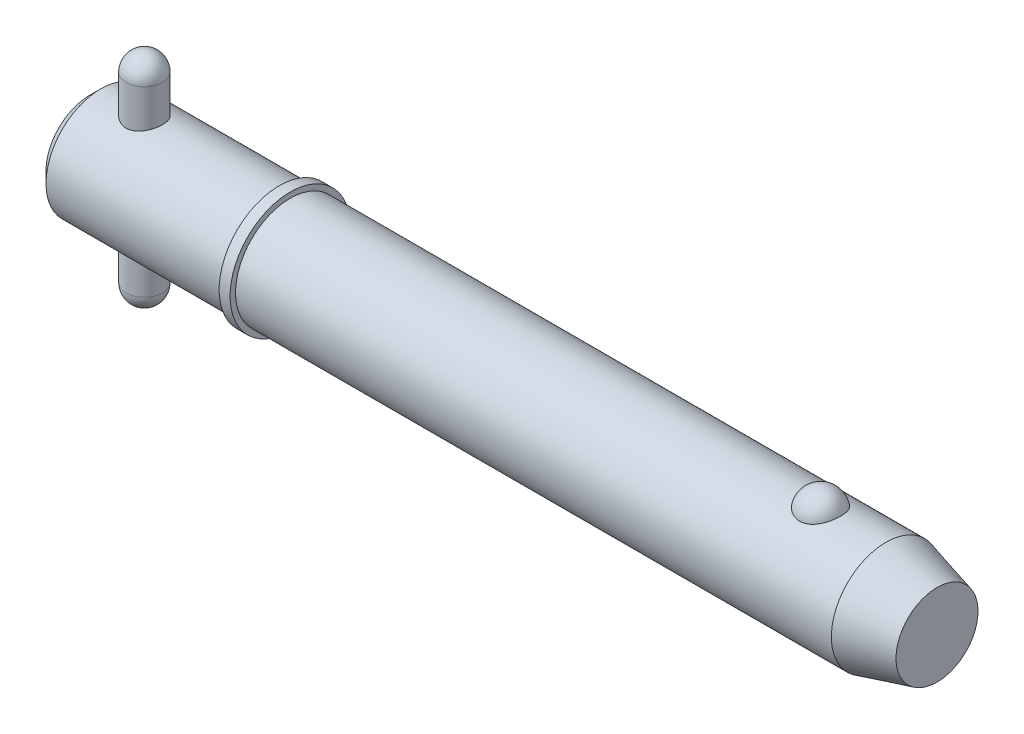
ISO-10303-21;
HEADER;
FILE_DESCRIPTION(('STEP AP214'),'2;1');
FILE_NAME('part.step','',(''),(''),'','','');
FILE_SCHEMA(('AUTOMOTIVE_DESIGN { 1 0 10303 214 1 1 1 1 }'));
ENDSEC;
DATA;
#1=APPLICATION_CONTEXT('core data for automotive mechanical design processes');
#2=APPLICATION_PROTOCOL_DEFINITION('international standard','automotive_design',2000,#1);
#3=PRODUCT_CONTEXT('',#1,'mechanical');
#4=PRODUCT('Part','Part','',(#3));
#5=PRODUCT_RELATED_PRODUCT_CATEGORY('part','',(#4));
#6=PRODUCT_DEFINITION_FORMATION('','',#4);
#7=PRODUCT_DEFINITION_CONTEXT('part definition',#1,'design');
#8=PRODUCT_DEFINITION('design','',#6,#7);
#9=PRODUCT_DEFINITION_SHAPE('','',#8);
#10=(LENGTH_UNIT() NAMED_UNIT(*) SI_UNIT(.MILLI.,.METRE.));
#11=(NAMED_UNIT(*) PLANE_ANGLE_UNIT() SI_UNIT($,.RADIAN.));
#12=(NAMED_UNIT(*) SI_UNIT($,.STERADIAN.) SOLID_ANGLE_UNIT());
#13=UNCERTAINTY_MEASURE_WITH_UNIT(LENGTH_MEASURE(1.E-05),#10,'distance_accuracy_value','');
#14=(GEOMETRIC_REPRESENTATION_CONTEXT(3) GLOBAL_UNCERTAINTY_ASSIGNED_CONTEXT((#13)) GLOBAL_UNIT_ASSIGNED_CONTEXT((#10,
#11,#12)) REPRESENTATION_CONTEXT('',''));
#15=CARTESIAN_POINT('',(0.,0.,0.));
#16=DIRECTION('',(0.,0.,1.));
#17=DIRECTION('',(1.,0.,0.));
#18=AXIS2_PLACEMENT_3D('',#15,#16,#17);
#19=CARTESIAN_POINT('',(9.525,19.05,0.));
#20=DIRECTION('',(0.,-1.,0.));
#21=DIRECTION('',(0.,0.,-1.));
#22=AXIS2_PLACEMENT_3D('',#19,#20,#21);
#23=CYLINDRICAL_SURFACE('',#22,3.175);
#24=CARTESIAN_POINT('',(9.525,-15.875,0.));
#25=DIRECTION('',(0.,-1.,0.));
#26=DIRECTION('',(0.,0.,-1.));
#27=AXIS2_PLACEMENT_3D('',#24,#25,#26);
#28=CIRCLE('',#27,3.175);
#29=CARTESIAN_POINT('',(9.525,-15.875,-3.175));
#30=VERTEX_POINT('',#29);
#31=EDGE_CURVE('P0_E10',#30,#30,#28,.F.);
#32=CARTESIAN_POINT('',(9.525,15.875,0.));
#33=DIRECTION('',(0.,-1.,0.));
#34=DIRECTION('',(0.,0.,-1.));
#35=AXIS2_PLACEMENT_3D('',#32,#33,#34);
#36=CIRCLE('',#35,3.175);
#37=CARTESIAN_POINT('',(9.525,15.875,-3.175));
#38=VERTEX_POINT('',#37);
#39=EDGE_CURVE('P0_E21',#38,#38,#36,.T.);
#40=CARTESIAN_POINT('',(9.525,-15.875,-3.175));
#41=CARTESIAN_POINT('',(9.525,-15.5442708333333,-3.175));
#42=CARTESIAN_POINT('',(9.525,-15.2135416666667,-3.175));
#43=CARTESIAN_POINT('',(9.525,-14.5520833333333,-3.175));
#44=CARTESIAN_POINT('',(9.525,-14.2213541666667,-3.175));
#45=CARTESIAN_POINT('',(9.525,-13.5598958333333,-3.175));
#46=CARTESIAN_POINT('',(9.525,-13.2291666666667,-3.175));
#47=CARTESIAN_POINT('',(9.525,-12.5677083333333,-3.175));
#48=CARTESIAN_POINT('',(9.525,-12.2369791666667,-3.175));
#49=CARTESIAN_POINT('',(9.525,-11.5755208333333,-3.175));
#50=CARTESIAN_POINT('',(9.525,-11.2447916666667,-3.175));
#51=CARTESIAN_POINT('',(9.525,-10.5833333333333,-3.175));
#52=CARTESIAN_POINT('',(9.525,-10.2526041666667,-3.175));
#53=CARTESIAN_POINT('',(9.525,-9.59114583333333,-3.175));
#54=CARTESIAN_POINT('',(9.525,-9.26041666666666,-3.175));
#55=CARTESIAN_POINT('',(9.525,-8.59895833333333,-3.175));
#56=CARTESIAN_POINT('',(9.525,-8.26822916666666,-3.175));
#57=CARTESIAN_POINT('',(9.525,-7.60677083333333,-3.175));
#58=CARTESIAN_POINT('',(9.525,-7.27604166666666,-3.175));
#59=CARTESIAN_POINT('',(9.525,-6.61458333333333,-3.175));
#60=CARTESIAN_POINT('',(9.525,-6.28385416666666,-3.175));
#61=CARTESIAN_POINT('',(9.525,-5.62239583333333,-3.175));
#62=CARTESIAN_POINT('',(9.525,-5.29166666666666,-3.175));
#63=CARTESIAN_POINT('',(9.525,-4.63020833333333,-3.175));
#64=CARTESIAN_POINT('',(9.525,-4.29947916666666,-3.175));
#65=CARTESIAN_POINT('',(9.525,-3.63802083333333,-3.175));
#66=CARTESIAN_POINT('',(9.525,-3.30729166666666,-3.175));
#67=CARTESIAN_POINT('',(9.525,-2.64583333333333,-3.175));
#68=CARTESIAN_POINT('',(9.525,-2.31510416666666,-3.175));
#69=CARTESIAN_POINT('',(9.525,-1.65364583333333,-3.175));
#70=CARTESIAN_POINT('',(9.525,-1.32291666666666,-3.175));
#71=CARTESIAN_POINT('',(9.525,-0.661458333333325,-3.175));
#72=CARTESIAN_POINT('',(9.525,-0.330729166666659,-3.175));
#73=CARTESIAN_POINT('',(9.525,0.330729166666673,-3.175));
#74=CARTESIAN_POINT('',(9.525,0.661458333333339,-3.175));
#75=CARTESIAN_POINT('',(9.525,1.32291666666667,-3.175));
#76=CARTESIAN_POINT('',(9.525,1.65364583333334,-3.175));
#77=CARTESIAN_POINT('',(9.525,2.31510416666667,-3.175));
#78=CARTESIAN_POINT('',(9.525,2.64583333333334,-3.175));
#79=CARTESIAN_POINT('',(9.525,3.30729166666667,-3.175));
#80=CARTESIAN_POINT('',(9.525,3.63802083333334,-3.175));
#81=CARTESIAN_POINT('',(9.525,4.29947916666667,-3.175));
#82=CARTESIAN_POINT('',(9.525,4.63020833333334,-3.175));
#83=CARTESIAN_POINT('',(9.525,5.29166666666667,-3.175));
#84=CARTESIAN_POINT('',(9.525,5.62239583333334,-3.175));
#85=CARTESIAN_POINT('',(9.525,6.28385416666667,-3.175));
#86=CARTESIAN_POINT('',(9.525,6.61458333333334,-3.175));
#87=CARTESIAN_POINT('',(9.525,7.27604166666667,-3.175));
#88=CARTESIAN_POINT('',(9.525,7.60677083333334,-3.175));
#89=CARTESIAN_POINT('',(9.525,8.26822916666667,-3.175));
#90=CARTESIAN_POINT('',(9.525,8.59895833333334,-3.175));
#91=CARTESIAN_POINT('',(9.525,9.26041666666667,-3.175));
#92=CARTESIAN_POINT('',(9.525,9.59114583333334,-3.175));
#93=CARTESIAN_POINT('',(9.525,10.2526041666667,-3.175));
#94=CARTESIAN_POINT('',(9.525,10.5833333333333,-3.175));
#95=CARTESIAN_POINT('',(9.525,11.2447916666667,-3.175));
#96=CARTESIAN_POINT('',(9.525,11.5755208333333,-3.175));
#97=CARTESIAN_POINT('',(9.525,12.2369791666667,-3.175));
#98=CARTESIAN_POINT('',(9.525,12.5677083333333,-3.175));
#99=CARTESIAN_POINT('',(9.525,13.2291666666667,-3.175));
#100=CARTESIAN_POINT('',(9.525,13.5598958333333,-3.175));
#101=CARTESIAN_POINT('',(9.525,14.2213541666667,-3.175));
#102=CARTESIAN_POINT('',(9.525,14.5520833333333,-3.175));
#103=CARTESIAN_POINT('',(9.525,15.2135416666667,-3.175));
#104=CARTESIAN_POINT('',(9.525,15.5442708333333,-3.175));
#105=CARTESIAN_POINT('',(9.525,15.875,-3.175));
#106=B_SPLINE_CURVE_WITH_KNOTS('',3,(#40,#41,#42,#43,#44,#45,#46,#47,#48,#49,#50,#51,#52,#53,
#54,#55,#56,#57,#58,#59,#60,#61,#62,#63,#64,#65,#66,#67,#68,#69,#70,#71,#72,#73,#74,#75,#76,#77,
#78,#79,#80,#81,#82,#83,#84,#85,#86,#87,#88,#89,#90,#91,#92,#93,#94,#95,#96,#97,#98,#99,#100,
#101,#102,#103,#104,#105),.UNSPECIFIED.,.F.,.F.,(4,2,2,2,2,2,2,2,2,2,2,2,2,2,2,2,2,2,2,2,2,2,2,
2,2,2,2,2,2,2,2,2,4),(0.,0.992187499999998,1.984375,2.9765625,3.96875,4.96093749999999,5.953125,
6.9453125,7.9375,8.92968749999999,9.921875,10.9140625,11.90625,12.8984375,13.890625,14.8828125,
15.875,16.8671875,17.859375,18.8515625,19.84375,20.8359375,21.828125,22.8203125,23.8125,
24.8046875,25.796875,26.7890625,27.78125,28.7734375,29.765625,30.7578125,31.75),.UNSPECIFIED.);
#107=EDGE_CURVE('P0_BSEAM14',#30,#38,#106,.T.);
#108=ORIENTED_EDGE('',*,*,#31,.T.);
#109=ORIENTED_EDGE('',*,*,#39,.T.);
#110=ORIENTED_EDGE('',*,*,#107,.T.);
#111=ORIENTED_EDGE('',*,*,#107,.F.);
#112=EDGE_LOOP('',(#108,#110,#109,#111));
#113=FACE_BOUND('',#112,.T.);
#114=ADVANCED_FACE('P0_F14',(#113),#23,.T.);
#115=CARTESIAN_POINT('',(9.525,-15.875,0.));
#116=DIRECTION('',(0.,0.,1.));
#117=DIRECTION('',(1.,0.,0.));
#118=AXIS2_PLACEMENT_3D('',#115,#116,#117);
#119=SPHERICAL_SURFACE('',#118,3.175);
#120=CARTESIAN_POINT('',(9.525,-15.875,0.));
#121=DIRECTION('',(0.,-1.,0.));
#122=DIRECTION('',(0.,0.,-1.));
#123=AXIS2_PLACEMENT_3D('',#120,#121,#122);
#124=SPHERICAL_SURFACE('',#123,3.175);
#125=ORIENTED_EDGE('',*,*,#31,.F.);
#126=EDGE_LOOP('',(#125));
#127=FACE_BOUND('',#126,.T.);
#128=ADVANCED_FACE('P0_F29',(#127),#124,.T.);
#129=CARTESIAN_POINT('',(9.525,15.875,0.));
#130=DIRECTION('',(0.,0.,1.));
#131=DIRECTION('',(1.,0.,0.));
#132=AXIS2_PLACEMENT_3D('',#129,#130,#131);
#133=SPHERICAL_SURFACE('',#132,3.175);
#134=CARTESIAN_POINT('',(9.525,15.875,0.));
#135=DIRECTION('',(0.,-1.,0.));
#136=DIRECTION('',(0.,0.,-1.));
#137=AXIS2_PLACEMENT_3D('',#134,#135,#136);
#138=SPHERICAL_SURFACE('',#137,3.175);
#139=ORIENTED_EDGE('',*,*,#39,.F.);
#140=EDGE_LOOP('',(#139));
#141=FACE_BOUND('',#140,.T.);
#142=ADVANCED_FACE('P0_F16',(#141),#138,.T.);
#143=CLOSED_SHELL('',(#114,#128,#142));
#144=MANIFOLD_SOLID_BREP('P0_B1',#143);
#145=CARTESIAN_POINT('',(0.,0.,0.));
#146=DIRECTION('',(1.,0.,0.));
#147=DIRECTION('',(0.,0.,-1.));
#148=AXIS2_PLACEMENT_3D('',#145,#146,#147);
#149=CYLINDRICAL_SURFACE('',#148,9.525);
#150=CARTESIAN_POINT('',(138.743054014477,0.,0.));
#151=DIRECTION('',(1.,0.,0.));
#152=DIRECTION('',(0.,0.,-1.));
#153=AXIS2_PLACEMENT_3D('',#150,#151,#152);
#154=CIRCLE('',#153,9.525);
#155=CARTESIAN_POINT('',(138.743054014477,0.,-9.525));
#156=VERTEX_POINT('',#155);
#157=EDGE_CURVE('P1_E81',#156,#156,#154,.T.);
#158=ORIENTED_EDGE('',*,*,#157,.F.);
#159=EDGE_LOOP('',(#158));
#160=FACE_BOUND('',#159,.T.);
#161=CARTESIAN_POINT('',(34.93,0.,0.));
#162=DIRECTION('',(1.,0.,0.));
#163=DIRECTION('',(0.,0.,-1.));
#164=AXIS2_PLACEMENT_3D('',#161,#162,#163);
#165=CIRCLE('',#164,9.525);
#166=CARTESIAN_POINT('',(34.93,0.,-9.525));
#167=VERTEX_POINT('',#166);
#168=EDGE_CURVE('P1_E85',#167,#167,#165,.T.);
#169=ORIENTED_EDGE('',*,*,#168,.T.);
#170=EDGE_LOOP('',(#169));
#171=FACE_BOUND('',#170,.T.);
#172=CARTESIAN_POINT('',(127.345757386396,8.80405803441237,3.63513233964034));
#173=CARTESIAN_POINT('',(127.251676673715,8.80405953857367,3.63513053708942));
#174=CARTESIAN_POINT('',(127.157561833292,8.80561325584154,3.63137461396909));
#175=CARTESIAN_POINT('',(126.970012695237,8.81177748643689,3.61638665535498));
#176=CARTESIAN_POINT('',(126.876578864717,8.81638992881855,3.60514990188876));
#177=CARTESIAN_POINT('',(126.597945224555,8.8346711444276,3.56024627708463));
#178=CARTESIAN_POINT('',(126.414691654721,8.85278327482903,3.51538626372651));
#179=CARTESIAN_POINT('',(126.059509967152,8.89871214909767,3.39742145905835));
#180=CARTESIAN_POINT('',(125.887553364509,8.92650327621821,3.32439116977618));
#181=CARTESIAN_POINT('',(125.558707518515,8.98874819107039,3.15220244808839));
#182=CARTESIAN_POINT('',(125.401811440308,9.02319893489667,3.05305594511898));
#183=CARTESIAN_POINT('',(125.102214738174,9.09629186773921,2.82797815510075));
#184=CARTESIAN_POINT('',(124.960060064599,9.13502685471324,2.70135138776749));
#185=CARTESIAN_POINT('',(124.698299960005,9.2118657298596,2.42641932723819));
#186=CARTESIAN_POINT('',(124.578701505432,9.2499694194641,2.27810735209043));
#187=CARTESIAN_POINT('',(124.359645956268,9.32341082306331,1.95652290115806));
#188=CARTESIAN_POINT('',(124.261317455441,9.35855090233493,1.78243511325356));
#189=CARTESIAN_POINT('',(124.093819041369,9.42045142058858,1.41937246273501));
#190=CARTESIAN_POINT('',(124.024651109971,9.44721128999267,1.23039658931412));
#191=CARTESIAN_POINT('',(123.916199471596,9.48990641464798,0.840370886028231));
#192=CARTESIAN_POINT('',(123.877288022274,9.50570658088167,0.639202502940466));
#193=CARTESIAN_POINT('',(123.831555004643,9.52433146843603,0.232664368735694));
#194=CARTESIAN_POINT('',(123.824732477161,9.52715657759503,0.0272947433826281));
#195=CARTESIAN_POINT('',(123.843255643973,9.51956918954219,-0.380478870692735));
#196=CARTESIAN_POINT('',(123.868405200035,9.50923740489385,-0.582893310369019));
#197=CARTESIAN_POINT('',(123.95002537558,9.47651897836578,-0.980293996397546));
#198=CARTESIAN_POINT('',(124.006496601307,9.45413210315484,-1.17528009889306));
#199=CARTESIAN_POINT('',(124.149719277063,9.39954044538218,-1.55263697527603));
#200=CARTESIAN_POINT('',(124.236512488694,9.36732213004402,-1.73498993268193));
#201=CARTESIAN_POINT('',(124.438610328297,9.29640700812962,-2.08177763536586));
#202=CARTESIAN_POINT('',(124.553917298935,9.25770966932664,-2.24621090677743));
#203=CARTESIAN_POINT('',(124.811264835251,9.17775604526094,-2.55338333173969));
#204=CARTESIAN_POINT('',(124.953434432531,9.13648808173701,-2.69601150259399));
#205=CARTESIAN_POINT('',(125.26089985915,9.05620497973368,-2.95451229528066));
#206=CARTESIAN_POINT('',(125.426193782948,9.01718965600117,-3.07038711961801));
#207=CARTESIAN_POINT('',(125.772052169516,8.94680019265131,-3.26976836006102));
#208=CARTESIAN_POINT('',(125.952227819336,8.91528408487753,-3.353897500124));
#209=CARTESIAN_POINT('',(126.325651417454,8.86272514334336,-3.49043503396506));
#210=CARTESIAN_POINT('',(126.518894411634,8.84167836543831,-3.54285537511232));
#211=CARTESIAN_POINT('',(126.902503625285,8.81348056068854,-3.61241306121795));
#212=CARTESIAN_POINT('',(127.092525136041,8.80568348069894,-3.63119339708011));
#213=CARTESIAN_POINT('',(127.473190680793,8.80289410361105,-3.63795342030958));
#214=CARTESIAN_POINT('',(127.663834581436,8.80789922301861,-3.62593932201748));
#215=CARTESIAN_POINT('',(128.034007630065,8.82974915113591,-3.57238430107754));
#216=CARTESIAN_POINT('',(128.213697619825,8.84621463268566,-3.53178890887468));
#217=CARTESIAN_POINT('',(128.563422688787,8.88875330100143,-3.42331083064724));
#218=CARTESIAN_POINT('',(128.733456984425,8.91482726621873,-3.35542593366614));
#219=CARTESIAN_POINT('',(129.063237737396,8.97448239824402,-3.19248225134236));
#220=CARTESIAN_POINT('',(129.222680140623,9.00821446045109,-3.09686474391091));
#221=CARTESIAN_POINT('',(129.523513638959,9.07935398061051,-2.88162736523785));
#222=CARTESIAN_POINT('',(129.664900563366,9.11676228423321,-2.76200196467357));
#223=CARTESIAN_POINT('',(129.93331931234,9.19347419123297,-2.49516285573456));
#224=CARTESIAN_POINT('',(130.059275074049,9.23277872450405,-2.34686614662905));
#225=CARTESIAN_POINT('',(130.285522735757,9.3073761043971,-2.0309368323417));
#226=CARTESIAN_POINT('',(130.38581004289,9.34266823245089,-1.86330077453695));
#227=CARTESIAN_POINT('',(130.561514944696,9.40674710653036,-1.50744893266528));
#228=CARTESIAN_POINT('',(130.636041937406,9.43529176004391,-1.31874876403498));
#229=CARTESIAN_POINT('',(130.75416505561,9.48144132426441,-0.93063102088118));
#230=CARTESIAN_POINT('',(130.797760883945,9.49904612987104,-0.731213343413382));
#231=CARTESIAN_POINT('',(130.853158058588,9.5215314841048,-0.32714729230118));
#232=CARTESIAN_POINT('',(130.864935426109,9.52640243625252,-0.122495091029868));
#233=CARTESIAN_POINT('',(130.856382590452,9.5228957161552,0.286018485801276));
#234=CARTESIAN_POINT('',(130.83605305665,9.5145183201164,0.489879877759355));
#235=CARTESIAN_POINT('',(130.763884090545,9.48544083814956,0.889994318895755));
#236=CARTESIAN_POINT('',(130.712199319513,9.46480124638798,1.08627971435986));
#237=CARTESIAN_POINT('',(130.578491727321,9.4133389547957,1.46682086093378));
#238=CARTESIAN_POINT('',(130.496466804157,9.38251554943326,1.65107577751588));
#239=CARTESIAN_POINT('',(130.30319292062,9.31365636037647,2.00346348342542));
#240=CARTESIAN_POINT('',(130.191783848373,9.27558138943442,2.17150083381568));
#241=CARTESIAN_POINT('',(129.942294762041,9.19638714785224,2.48563115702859));
#242=CARTESIAN_POINT('',(129.804216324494,9.15526805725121,2.63172542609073));
#243=CARTESIAN_POINT('',(129.504843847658,9.07465393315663,2.89750997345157));
#244=CARTESIAN_POINT('',(129.343610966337,9.03515496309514,3.01726776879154));
#245=CARTESIAN_POINT('',(129.001613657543,8.96227564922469,3.22732920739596));
#246=CARTESIAN_POINT('',(128.820841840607,8.92889763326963,3.31762165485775));
#247=CARTESIAN_POINT('',(128.451445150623,8.8734538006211,3.46314419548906));
#248=CARTESIAN_POINT('',(128.26332371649,8.85102983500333,3.51950082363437));
#249=CARTESIAN_POINT('',(127.97578699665,8.8266696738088,3.57993683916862));
#250=CARTESIAN_POINT('',(127.879133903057,8.82009725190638,3.59606217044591));
#251=CARTESIAN_POINT('',(127.684677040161,8.81020897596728,3.62022512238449));
#252=CARTESIAN_POINT('',(127.58687410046,8.80689090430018,3.62826825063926));
#253=CARTESIAN_POINT('',(127.441224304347,8.80445615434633,3.63416760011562));
#254=CARTESIAN_POINT('',(127.393495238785,8.80405727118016,3.63513325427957));
#255=CARTESIAN_POINT('',(127.345757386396,8.80405803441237,3.63513233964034));
#256=B_SPLINE_CURVE_WITH_KNOTS('',3,(#172,#173,#174,#175,#176,#177,#178,#179,#180,#181,#182,
#183,#184,#185,#186,#187,#188,#189,#190,#191,#192,#193,#194,#195,#196,#197,#198,#199,#200,#201,
#202,#203,#204,#205,#206,#207,#208,#209,#210,#211,#212,#213,#214,#215,#216,#217,#218,#219,#220,
#221,#222,#223,#224,#225,#226,#227,#228,#229,#230,#231,#232,#233,#234,#235,#236,#237,#238,#239,
#240,#241,#242,#243,#244,#245,#246,#247,#248,#249,#250,#251,#252,#253,#254,#255),.UNSPECIFIED.,
.T.,.F.,(4,2,2,2,2,2,2,2,2,2,2,2,2,2,2,2,2,2,2,2,2,2,2,2,2,2,2,2,2,2,2,2,2,2,2,2,2,2,2,2,2,4),
(0.,0.282202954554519,0.564584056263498,1.13017050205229,1.69427128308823,2.25811483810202,
2.83836627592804,3.41879688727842,4.02497117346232,4.63118665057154,5.24474754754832,
5.85829010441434,6.46808687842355,7.07789545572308,7.68854723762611,8.29924920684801,
8.91296283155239,9.52662591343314,10.1275338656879,10.7282152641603,11.2986646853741,
11.868998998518,12.4213015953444,12.973648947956,13.5380053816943,14.1024919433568,
14.695298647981,15.2882113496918,15.8999469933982,16.5116885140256,17.1238909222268,
17.7360805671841,18.3452748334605,18.9545113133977,19.567138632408,20.179729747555,
20.7907316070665,21.4019653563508,21.9915938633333,22.2859053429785,22.5800161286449,
22.7232098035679),.UNSPECIFIED.);
#257=CARTESIAN_POINT('',(127.345757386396,8.80405803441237,3.63513233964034));
#258=VERTEX_POINT('',#257);
#259=EDGE_CURVE('P1_E35',#258,#258,#256,.T.);
#260=ORIENTED_EDGE('',*,*,#259,.T.);
#261=EDGE_LOOP('',(#260));
#262=FACE_BOUND('',#261,.T.);
#263=ADVANCED_FACE('P1_F13',(#160,#171,#262),#149,.T.);
#264=CARTESIAN_POINT('',(0.,0.,0.));
#265=DIRECTION('',(-1.,0.,0.));
#266=DIRECTION('',(0.,0.,1.));
#267=AXIS2_PLACEMENT_3D('',#264,#265,#266);
#268=PLANE('',#267);
#269=CARTESIAN_POINT('',(0.,0.,0.));
#270=DIRECTION('',(1.,0.,0.));
#271=DIRECTION('',(0.,0.,-1.));
#272=AXIS2_PLACEMENT_3D('',#269,#270,#271);
#273=CIRCLE('',#272,7.62);
#274=CARTESIAN_POINT('',(0.,0.,-7.62));
#275=VERTEX_POINT('',#274);
#276=EDGE_CURVE('P1_E9',#275,#275,#273,.T.);
#277=ORIENTED_EDGE('',*,*,#276,.F.);
#278=EDGE_LOOP('',(#277));
#279=FACE_BOUND('',#278,.T.);
#280=ADVANCED_FACE('P1_F15',(#279),#268,.T.);
#281=CARTESIAN_POINT('',(1.90499999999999,0.,0.));
#282=DIRECTION('',(1.,0.,0.));
#283=DIRECTION('',(0.,0.,-1.));
#284=AXIS2_PLACEMENT_3D('',#281,#282,#283);
#285=CONICAL_SURFACE('',#284,9.525,0.785398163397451);
#286=ORIENTED_EDGE('',*,*,#276,.T.);
#287=EDGE_LOOP('',(#286));
#288=FACE_BOUND('',#287,.T.);
#289=CARTESIAN_POINT('',(1.90499999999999,0.,0.));
#290=DIRECTION('',(1.,0.,0.));
#291=DIRECTION('',(0.,0.,-1.));
#292=AXIS2_PLACEMENT_3D('',#289,#290,#291);
#293=CIRCLE('',#292,9.525);
#294=CARTESIAN_POINT('',(1.90499999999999,0.,-9.525));
#295=VERTEX_POINT('',#294);
#296=EDGE_CURVE('P1_E26',#295,#295,#293,.T.);
#297=ORIENTED_EDGE('',*,*,#296,.F.);
#298=EDGE_LOOP('',(#297));
#299=FACE_BOUND('',#298,.T.);
#300=ADVANCED_FACE('P1_F77',(#288,#299),#285,.T.);
#301=CARTESIAN_POINT('',(0.,0.,0.));
#302=DIRECTION('',(1.,0.,0.));
#303=DIRECTION('',(0.,0.,-1.));
#304=AXIS2_PLACEMENT_3D('',#301,#302,#303);
#305=CYLINDRICAL_SURFACE('',#304,9.525);
#306=CARTESIAN_POINT('',(9.525,-8.98025612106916,3.175));
#307=CARTESIAN_POINT('',(9.35206354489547,-8.98025555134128,3.17500081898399));
#308=CARTESIAN_POINT('',(9.17913201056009,-8.98530617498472,3.16082293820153));
#309=CARTESIAN_POINT('',(8.83839221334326,-9.00485797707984,3.10467734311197));
#310=CARTESIAN_POINT('',(8.67058479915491,-9.0193607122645,3.06270505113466));
#311=CARTESIAN_POINT('',(8.34508461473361,-9.05599546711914,2.95260866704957));
#312=CARTESIAN_POINT('',(8.18737272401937,-9.07811252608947,2.88453582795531));
#313=CARTESIAN_POINT('',(7.88555684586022,-9.12746212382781,2.72434567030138));
#314=CARTESIAN_POINT('',(7.74145587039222,-9.1546957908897,2.63222304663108));
#315=CARTESIAN_POINT('',(7.46531411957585,-9.21240503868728,2.42268738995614));
#316=CARTESIAN_POINT('',(7.33388351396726,-9.24296141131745,2.30449228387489));
#317=CARTESIAN_POINT('',(7.09229340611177,-9.30319020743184,2.0478358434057));
#318=CARTESIAN_POINT('',(6.98213731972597,-9.33286248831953,1.90937126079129));
#319=CARTESIAN_POINT('',(6.78345450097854,-9.38891527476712,1.61164431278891));
#320=CARTESIAN_POINT('',(6.69556709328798,-9.41518969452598,1.45193356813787));
#321=CARTESIAN_POINT('',(6.54814671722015,-9.46053437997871,1.11896913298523));
#322=CARTESIAN_POINT('',(6.48860610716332,-9.47960658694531,0.945719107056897));
#323=CARTESIAN_POINT('',(6.40163866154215,-9.50782564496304,0.596991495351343));
#324=CARTESIAN_POINT('',(6.373166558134,-9.5172947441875,0.421801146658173));
#325=CARTESIAN_POINT('',(6.3458207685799,-9.52638456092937,0.068890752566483));
#326=CARTESIAN_POINT('',(6.34693945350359,-9.52600781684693,-0.108828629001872));
#327=CARTESIAN_POINT('',(6.37808050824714,-9.51566675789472,-0.454353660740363));
#328=CARTESIAN_POINT('',(6.4069675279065,-9.50607905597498,-0.622274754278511));
#329=CARTESIAN_POINT('',(6.490947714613,-9.47886621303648,-0.950732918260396));
#330=CARTESIAN_POINT('',(6.54604265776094,-9.46124052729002,-1.11126948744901));
#331=CARTESIAN_POINT('',(6.68153768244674,-9.41945253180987,-1.42288410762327));
#332=CARTESIAN_POINT('',(6.76226085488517,-9.3952073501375,-1.57381010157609));
#333=CARTESIAN_POINT('',(6.94645456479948,-9.34270397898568,-1.86030973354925));
#334=CARTESIAN_POINT('',(7.04993142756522,-9.31444467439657,-1.99587908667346));
#335=CARTESIAN_POINT('',(7.28241619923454,-9.25532159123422,-2.2545702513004));
#336=CARTESIAN_POINT('',(7.4123967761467,-9.22439783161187,-2.37680549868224));
#337=CARTESIAN_POINT('',(7.69127470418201,-9.1645528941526,-2.5980302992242));
#338=CARTESIAN_POINT('',(7.84017496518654,-9.13563202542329,-2.6970162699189));
#339=CARTESIAN_POINT('',(8.15547526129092,-9.08273917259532,-2.87016016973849));
#340=CARTESIAN_POINT('',(8.32209451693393,-9.05884361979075,-2.94394402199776));
#341=CARTESIAN_POINT('',(8.66638917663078,-9.01959241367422,-3.06210713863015));
#342=CARTESIAN_POINT('',(8.84405991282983,-9.00423318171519,-3.10649872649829));
#343=CARTESIAN_POINT('',(9.19682677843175,-8.98460345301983,-3.16281207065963));
#344=CARTESIAN_POINT('',(9.37167742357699,-8.9798639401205,-3.17610837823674));
#345=CARTESIAN_POINT('',(9.72113927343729,-8.9806993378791,-3.17374726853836));
#346=CARTESIAN_POINT('',(9.89575051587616,-8.98627237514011,-3.15809511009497));
#347=CARTESIAN_POINT('',(10.2335233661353,-9.00663737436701,-3.09951644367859));
#348=CARTESIAN_POINT('',(10.3968722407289,-9.02110608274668,-3.05754530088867));
#349=CARTESIAN_POINT('',(10.7141759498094,-9.05727657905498,-2.94866651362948));
#350=CARTESIAN_POINT('',(10.8681291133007,-9.07897964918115,-2.88175444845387));
#351=CARTESIAN_POINT('',(11.1676828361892,-9.12802586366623,-2.72248103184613));
#352=CARTESIAN_POINT('',(11.3128635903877,-9.1555260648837,-2.62937980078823));
#353=CARTESIAN_POINT('',(11.5860387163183,-9.21276315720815,-2.42120937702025));
#354=CARTESIAN_POINT('',(11.7140280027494,-9.24250070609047,-2.30613370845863));
#355=CARTESIAN_POINT('',(11.9555513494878,-9.30259247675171,-2.05070616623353));
#356=CARTESIAN_POINT('',(12.0680936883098,-9.33290753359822,-1.90940458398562));
#357=CARTESIAN_POINT('',(12.267933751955,-9.3893275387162,-1.60917665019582));
#358=CARTESIAN_POINT('',(12.3552323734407,-9.41543263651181,-1.45025092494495));
#359=CARTESIAN_POINT('',(12.5013088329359,-9.46036988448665,-1.12007606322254));
#360=CARTESIAN_POINT('',(12.5602723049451,-9.47924920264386,-0.9489158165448));
#361=CARTESIAN_POINT('',(12.6483355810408,-9.50781089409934,-0.598355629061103));
#362=CARTESIAN_POINT('',(12.6774461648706,-9.5174965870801,-0.4189586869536));
#363=CARTESIAN_POINT('',(12.7040070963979,-9.52632915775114,-0.066088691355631));
#364=CARTESIAN_POINT('',(12.7028811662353,-9.52594996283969,0.107266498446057));
#365=CARTESIAN_POINT('',(12.6725130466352,-9.51586223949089,0.451202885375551));
#366=CARTESIAN_POINT('',(12.643273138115,-9.50615446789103,0.621784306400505));
#367=CARTESIAN_POINT('',(12.5584514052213,-9.47867404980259,0.952633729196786));
#368=CARTESIAN_POINT('',(12.5032953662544,-9.46103195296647,1.1130225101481));
#369=CARTESIAN_POINT('',(12.3686013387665,-9.41949985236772,1.42233126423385));
#370=CARTESIAN_POINT('',(12.2890589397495,-9.39560871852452,1.57124915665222));
#371=CARTESIAN_POINT('',(12.1044667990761,-9.34294133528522,1.85938800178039));
#372=CARTESIAN_POINT('',(11.9985831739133,-9.31401720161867,1.9980473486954));
#373=CARTESIAN_POINT('',(11.7657327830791,-9.25490239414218,2.25609475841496));
#374=CARTESIAN_POINT('',(11.6387592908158,-9.22471131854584,2.37547664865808));
#375=CARTESIAN_POINT('',(11.3613902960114,-9.16505913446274,2.59633024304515));
#376=CARTESIAN_POINT('',(11.2102725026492,-9.13567286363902,2.69691791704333));
#377=CARTESIAN_POINT('',(10.8923631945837,-9.08241113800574,2.87119803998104));
#378=CARTESIAN_POINT('',(10.7255757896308,-9.05853424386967,2.94489751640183));
#379=CARTESIAN_POINT('',(10.3887212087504,-9.02021736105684,3.06020415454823));
#380=CARTESIAN_POINT('',(10.219143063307,-9.00539959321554,3.10311136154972));
#381=CARTESIAN_POINT('',(9.87470703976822,-8.98542092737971,3.16050396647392));
#382=CARTESIAN_POINT('',(9.699851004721,-8.98025669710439,3.17499917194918));
#383=CARTESIAN_POINT('',(9.525,-8.98025612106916,3.175));
#384=B_SPLINE_CURVE_WITH_KNOTS('',3,(#306,#307,#308,#309,#310,#311,#312,#313,#314,#315,#316,
#317,#318,#319,#320,#321,#322,#323,#324,#325,#326,#327,#328,#329,#330,#331,#332,#333,#334,#335,
#336,#337,#338,#339,#340,#341,#342,#343,#344,#345,#346,#347,#348,#349,#350,#351,#352,#353,#354,
#355,#356,#357,#358,#359,#360,#361,#362,#363,#364,#365,#366,#367,#368,#369,#370,#371,#372,#373,
#374,#375,#376,#377,#378,#379,#380,#381,#382,#383),.UNSPECIFIED.,.T.,.F.,(4,2,2,2,2,2,2,2,2,2,2,
2,2,2,2,2,2,2,2,2,2,2,2,2,2,2,2,2,2,2,2,2,2,2,2,2,2,2,4),(0.,0.518161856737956,1.03640907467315,
1.55364379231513,2.07099270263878,2.60671746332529,3.14252816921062,3.69231882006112,
4.24196117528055,4.77247962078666,5.30286129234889,5.81244090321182,6.32205505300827,
6.83836754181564,7.3548237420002,7.89559553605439,8.43645060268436,8.98501631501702,
9.53335188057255,10.056948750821,10.5804505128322,11.0859695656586,11.5915782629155,
12.1132237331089,12.6350231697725,13.1819271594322,13.7288117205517,14.2720628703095,
14.815117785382,15.3326491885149,15.8501386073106,16.3594083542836,16.868770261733,
17.3969527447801,17.925304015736,18.4743376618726,19.023227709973,19.5473069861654,
20.0712053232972),.UNSPECIFIED.);
#385=CARTESIAN_POINT('',(9.525,-8.98025612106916,3.175));
#386=VERTEX_POINT('',#385);
#387=EDGE_CURVE('P1_E17',#386,#386,#384,.T.);
#388=ORIENTED_EDGE('',*,*,#387,.F.);
#389=EDGE_LOOP('',(#388));
#390=FACE_BOUND('',#389,.T.);
#391=CARTESIAN_POINT('',(9.525,8.98025612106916,3.175));
#392=CARTESIAN_POINT('',(9.69793645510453,8.98025555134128,3.17500081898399));
#393=CARTESIAN_POINT('',(9.87086798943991,8.98530617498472,3.16082293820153));
#394=CARTESIAN_POINT('',(10.2116077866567,9.00485797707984,3.10467734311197));
#395=CARTESIAN_POINT('',(10.3794152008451,9.0193607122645,3.06270505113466));
#396=CARTESIAN_POINT('',(10.7049153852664,9.05599546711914,2.95260866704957));
#397=CARTESIAN_POINT('',(10.8626272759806,9.07811252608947,2.88453582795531));
#398=CARTESIAN_POINT('',(11.1644431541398,9.12746212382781,2.72434567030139));
#399=CARTESIAN_POINT('',(11.3085441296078,9.15469579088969,2.63222304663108));
#400=CARTESIAN_POINT('',(11.5846858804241,9.21240503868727,2.42268738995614));
#401=CARTESIAN_POINT('',(11.7161164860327,9.24296141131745,2.30449228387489));
#402=CARTESIAN_POINT('',(11.9577065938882,9.30319020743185,2.0478358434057));
#403=CARTESIAN_POINT('',(12.067862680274,9.33286248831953,1.90937126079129));
#404=CARTESIAN_POINT('',(12.2665454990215,9.38891527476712,1.61164431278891));
#405=CARTESIAN_POINT('',(12.354432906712,9.41518969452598,1.45193356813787));
#406=CARTESIAN_POINT('',(12.5018532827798,9.46053437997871,1.11896913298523));
#407=CARTESIAN_POINT('',(12.5613938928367,9.47960658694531,0.945719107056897));
#408=CARTESIAN_POINT('',(12.6483613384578,9.50782564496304,0.596991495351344));
#409=CARTESIAN_POINT('',(12.676833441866,9.5172947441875,0.421801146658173));
#410=CARTESIAN_POINT('',(12.7041792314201,9.52638456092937,0.0688907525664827));
#411=CARTESIAN_POINT('',(12.7030605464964,9.52600781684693,-0.108828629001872));
#412=CARTESIAN_POINT('',(12.6719194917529,9.51566675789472,-0.454353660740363));
#413=CARTESIAN_POINT('',(12.6430324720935,9.50607905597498,-0.622274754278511));
#414=CARTESIAN_POINT('',(12.559052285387,9.47886621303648,-0.950732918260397));
#415=CARTESIAN_POINT('',(12.5039573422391,9.46124052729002,-1.11126948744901));
#416=CARTESIAN_POINT('',(12.3684623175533,9.41945253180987,-1.42288410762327));
#417=CARTESIAN_POINT('',(12.2877391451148,9.3952073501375,-1.57381010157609));
#418=CARTESIAN_POINT('',(12.1035454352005,9.34270397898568,-1.86030973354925));
#419=CARTESIAN_POINT('',(12.0000685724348,9.31444467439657,-1.99587908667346));
#420=CARTESIAN_POINT('',(11.7675838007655,9.25532159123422,-2.2545702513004));
#421=CARTESIAN_POINT('',(11.6376032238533,9.22439783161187,-2.37680549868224));
#422=CARTESIAN_POINT('',(11.358725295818,9.1645528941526,-2.5980302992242));
#423=CARTESIAN_POINT('',(11.2098250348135,9.13563202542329,-2.6970162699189));
#424=CARTESIAN_POINT('',(10.8945247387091,9.08273917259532,-2.87016016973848));
#425=CARTESIAN_POINT('',(10.7279054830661,9.05884361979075,-2.94394402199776));
#426=CARTESIAN_POINT('',(10.3836108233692,9.01959241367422,-3.06210713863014));
#427=CARTESIAN_POINT('',(10.2059400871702,9.00423318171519,-3.10649872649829));
#428=CARTESIAN_POINT('',(9.85317322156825,8.98460345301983,-3.16281207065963));
#429=CARTESIAN_POINT('',(9.67832257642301,8.9798639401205,-3.17610837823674));
#430=CARTESIAN_POINT('',(9.32886072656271,8.9806993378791,-3.17374726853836));
#431=CARTESIAN_POINT('',(9.15424948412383,8.98627237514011,-3.15809511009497));
#432=CARTESIAN_POINT('',(8.81647663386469,9.00663737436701,-3.09951644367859));
#433=CARTESIAN_POINT('',(8.65312775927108,9.02110608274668,-3.05754530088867));
#434=CARTESIAN_POINT('',(8.33582405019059,9.05727657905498,-2.94866651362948));
#435=CARTESIAN_POINT('',(8.18187088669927,9.07897964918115,-2.88175444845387));
#436=CARTESIAN_POINT('',(7.88231716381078,9.12802586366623,-2.72248103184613));
#437=CARTESIAN_POINT('',(7.73713640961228,9.1555260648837,-2.62937980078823));
#438=CARTESIAN_POINT('',(7.46396128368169,9.21276315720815,-2.42120937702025));
#439=CARTESIAN_POINT('',(7.33597199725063,9.24250070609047,-2.30613370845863));
#440=CARTESIAN_POINT('',(7.09444865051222,9.30259247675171,-2.05070616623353));
#441=CARTESIAN_POINT('',(6.98190631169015,9.33290753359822,-1.90940458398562));
#442=CARTESIAN_POINT('',(6.78206624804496,9.3893275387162,-1.60917665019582));
#443=CARTESIAN_POINT('',(6.6947676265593,9.41543263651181,-1.45025092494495));
#444=CARTESIAN_POINT('',(6.54869116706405,9.46036988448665,-1.12007606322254));
#445=CARTESIAN_POINT('',(6.48972769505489,9.47924920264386,-0.948915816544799));
#446=CARTESIAN_POINT('',(6.40166441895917,9.50781089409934,-0.598355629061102));
#447=CARTESIAN_POINT('',(6.3725538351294,9.5174965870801,-0.418958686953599));
#448=CARTESIAN_POINT('',(6.34599290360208,9.52632915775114,-0.0660886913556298));
#449=CARTESIAN_POINT('',(6.3471188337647,9.52594996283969,0.107266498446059));
#450=CARTESIAN_POINT('',(6.37748695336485,9.51586223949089,0.451202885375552));
#451=CARTESIAN_POINT('',(6.40672686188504,9.50615446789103,0.621784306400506));
#452=CARTESIAN_POINT('',(6.49154859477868,9.47867404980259,0.952633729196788));
#453=CARTESIAN_POINT('',(6.54670463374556,9.46103195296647,1.11302251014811));
#454=CARTESIAN_POINT('',(6.68139866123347,9.41949985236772,1.42233126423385));
#455=CARTESIAN_POINT('',(6.76094106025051,9.39560871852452,1.57124915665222));
#456=CARTESIAN_POINT('',(6.94553320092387,9.34294133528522,1.85938800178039));
#457=CARTESIAN_POINT('',(7.05141682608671,9.31401720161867,1.9980473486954));
#458=CARTESIAN_POINT('',(7.28426721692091,9.25490239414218,2.25609475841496));
#459=CARTESIAN_POINT('',(7.41124070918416,9.22471131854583,2.37547664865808));
#460=CARTESIAN_POINT('',(7.68860970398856,9.16505913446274,2.59633024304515));
#461=CARTESIAN_POINT('',(7.83972749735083,9.13567286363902,2.69691791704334));
#462=CARTESIAN_POINT('',(8.15763680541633,9.08241113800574,2.87119803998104));
#463=CARTESIAN_POINT('',(8.32442421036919,9.05853424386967,2.94489751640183));
#464=CARTESIAN_POINT('',(8.66127879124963,9.02021736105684,3.06020415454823));
#465=CARTESIAN_POINT('',(8.83085693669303,9.00539959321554,3.10311136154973));
#466=CARTESIAN_POINT('',(9.17529296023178,8.98542092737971,3.16050396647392));
#467=CARTESIAN_POINT('',(9.350148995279,8.98025669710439,3.17499917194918));
#468=CARTESIAN_POINT('',(9.525,8.98025612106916,3.175));
#469=B_SPLINE_CURVE_WITH_KNOTS('',3,(#391,#392,#393,#394,#395,#396,#397,#398,#399,#400,#401,
#402,#403,#404,#405,#406,#407,#408,#409,#410,#411,#412,#413,#414,#415,#416,#417,#418,#419,#420,
#421,#422,#423,#424,#425,#426,#427,#428,#429,#430,#431,#432,#433,#434,#435,#436,#437,#438,#439,
#440,#441,#442,#443,#444,#445,#446,#447,#448,#449,#450,#451,#452,#453,#454,#455,#456,#457,#458,
#459,#460,#461,#462,#463,#464,#465,#466,#467,#468),.UNSPECIFIED.,.T.,.F.,(4,2,2,2,2,2,2,2,2,2,2,
2,2,2,2,2,2,2,2,2,2,2,2,2,2,2,2,2,2,2,2,2,2,2,2,2,2,2,4),(0.,0.518161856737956,1.03640907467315,
1.55364379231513,2.07099270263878,2.60671746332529,3.14252816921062,3.69231882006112,
4.24196117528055,4.77247962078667,5.30286129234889,5.81244090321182,6.32205505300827,
6.83836754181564,7.3548237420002,7.89559553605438,8.43645060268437,8.98501631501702,
9.53335188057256,10.056948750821,10.5804505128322,11.0859695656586,11.5915782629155,
12.1132237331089,12.6350231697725,13.1819271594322,13.7288117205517,14.2720628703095,
14.815117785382,15.3326491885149,15.8501386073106,16.3594083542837,16.868770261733,
17.3969527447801,17.9253040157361,18.4743376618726,19.023227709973,19.5473069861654,
20.0712053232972),.UNSPECIFIED.);
#470=CARTESIAN_POINT('',(9.525,8.98025612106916,3.175));
#471=VERTEX_POINT('',#470);
#472=EDGE_CURVE('P1_E43',#471,#471,#469,.T.);
#473=ORIENTED_EDGE('',*,*,#472,.F.);
#474=EDGE_LOOP('',(#473));
#475=FACE_BOUND('',#474,.T.);
#476=ORIENTED_EDGE('',*,*,#296,.T.);
#477=EDGE_LOOP('',(#476));
#478=FACE_BOUND('',#477,.T.);
#479=CARTESIAN_POINT('',(33.025,0.,0.));
#480=DIRECTION('',(1.,0.,0.));
#481=DIRECTION('',(0.,0.,-1.));
#482=AXIS2_PLACEMENT_3D('',#479,#480,#481);
#483=CIRCLE('',#482,9.525);
#484=CARTESIAN_POINT('',(33.025,0.,-9.525));
#485=VERTEX_POINT('',#484);
#486=EDGE_CURVE('P1_E31',#485,#485,#483,.T.);
#487=ORIENTED_EDGE('',*,*,#486,.F.);
#488=EDGE_LOOP('',(#487));
#489=FACE_BOUND('',#488,.T.);
#490=ADVANCED_FACE('P1_F103',(#390,#475,#478,#489),#305,.T.);
#491=CARTESIAN_POINT('',(33.025,9.525,0.));
#492=DIRECTION('',(-1.,0.,0.));
#493=DIRECTION('',(0.,0.,1.));
#494=AXIS2_PLACEMENT_3D('',#491,#492,#493);
#495=PLANE('',#494);
#496=ORIENTED_EDGE('',*,*,#486,.T.);
#497=EDGE_LOOP('',(#496));
#498=FACE_BOUND('',#497,.T.);
#499=CARTESIAN_POINT('',(33.025,0.,0.));
#500=DIRECTION('',(1.,0.,0.));
#501=DIRECTION('',(0.,0.,-1.));
#502=AXIS2_PLACEMENT_3D('',#499,#500,#501);
#503=CIRCLE('',#502,10.4775);
#504=CARTESIAN_POINT('',(33.025,0.,-10.4775));
#505=VERTEX_POINT('',#504);
#506=EDGE_CURVE('P1_E91',#505,#505,#503,.T.);
#507=ORIENTED_EDGE('',*,*,#506,.F.);
#508=EDGE_LOOP('',(#507));
#509=FACE_BOUND('',#508,.T.);
#510=ADVANCED_FACE('P1_F100',(#498,#509),#495,.T.);
#511=CARTESIAN_POINT('',(0.,0.,0.));
#512=DIRECTION('',(1.,0.,0.));
#513=DIRECTION('',(0.,0.,-1.));
#514=AXIS2_PLACEMENT_3D('',#511,#512,#513);
#515=CYLINDRICAL_SURFACE('',#514,10.4775);
#516=ORIENTED_EDGE('',*,*,#506,.T.);
#517=EDGE_LOOP('',(#516));
#518=FACE_BOUND('',#517,.T.);
#519=CARTESIAN_POINT('',(34.93,0.,0.));
#520=DIRECTION('',(1.,0.,0.));
#521=DIRECTION('',(0.,0.,-1.));
#522=AXIS2_PLACEMENT_3D('',#519,#520,#521);
#523=CIRCLE('',#522,10.4775);
#524=CARTESIAN_POINT('',(34.93,0.,-10.4775));
#525=VERTEX_POINT('',#524);
#526=EDGE_CURVE('P1_E88',#525,#525,#523,.T.);
#527=ORIENTED_EDGE('',*,*,#526,.F.);
#528=EDGE_LOOP('',(#527));
#529=FACE_BOUND('',#528,.T.);
#530=ADVANCED_FACE('P1_F68',(#518,#529),#515,.T.);
#531=CARTESIAN_POINT('',(34.93,10.4775,0.));
#532=DIRECTION('',(1.,0.,0.));
#533=DIRECTION('',(0.,0.,-1.));
#534=AXIS2_PLACEMENT_3D('',#531,#532,#533);
#535=PLANE('',#534);
#536=ORIENTED_EDGE('',*,*,#526,.T.);
#537=EDGE_LOOP('',(#536));
#538=FACE_BOUND('',#537,.T.);
#539=ORIENTED_EDGE('',*,*,#168,.F.);
#540=EDGE_LOOP('',(#539));
#541=FACE_BOUND('',#540,.T.);
#542=ADVANCED_FACE('P1_F62',(#538,#541),#535,.T.);
#543=CARTESIAN_POINT('',(147.63,0.,0.));
#544=DIRECTION('',(-1.,0.,0.));
#545=DIRECTION('',(0.,0.,1.));
#546=AXIS2_PLACEMENT_3D('',#543,#544,#545);
#547=CONICAL_SURFACE('',#546,7.14375000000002,0.26179938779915);
#548=ORIENTED_EDGE('',*,*,#157,.T.);
#549=EDGE_LOOP('',(#548));
#550=FACE_BOUND('',#549,.T.);
#551=CARTESIAN_POINT('',(147.63,0.,0.));
#552=DIRECTION('',(1.,0.,0.));
#553=DIRECTION('',(0.,0.,-1.));
#554=AXIS2_PLACEMENT_3D('',#551,#552,#553);
#555=CIRCLE('',#554,7.14375000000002);
#556=CARTESIAN_POINT('',(147.63,0.,-7.14375000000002));
#557=VERTEX_POINT('',#556);
#558=EDGE_CURVE('P1_E42',#557,#557,#555,.T.);
#559=ORIENTED_EDGE('',*,*,#558,.F.);
#560=EDGE_LOOP('',(#559));
#561=FACE_BOUND('',#560,.T.);
#562=ADVANCED_FACE('P1_F59',(#550,#561),#547,.T.);
#563=CARTESIAN_POINT('',(147.63,7.14375000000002,0.));
#564=DIRECTION('',(1.,0.,0.));
#565=DIRECTION('',(0.,0.,-1.));
#566=AXIS2_PLACEMENT_3D('',#563,#564,#565);
#567=PLANE('',#566);
#568=ORIENTED_EDGE('',*,*,#558,.T.);
#569=EDGE_LOOP('',(#568));
#570=FACE_BOUND('',#569,.T.);
#571=ADVANCED_FACE('P1_F55',(#570),#567,.T.);
#572=CARTESIAN_POINT('',(127.345757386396,8.5725,0.));
#573=DIRECTION('',(-1.,0.,0.));
#574=DIRECTION('',(0.,1.,0.));
#575=AXIS2_PLACEMENT_3D('',#572,#573,#574);
#576=SPHERICAL_SURFACE('',#575,3.6425);
#577=ORIENTED_EDGE('',*,*,#259,.F.);
#578=EDGE_LOOP('',(#577));
#579=FACE_BOUND('',#578,.T.);
#580=ADVANCED_FACE('P1_F50',(#579),#576,.T.);
#581=CARTESIAN_POINT('',(9.525,-10.4775,0.));
#582=DIRECTION('',(0.,1.,0.));
#583=DIRECTION('',(0.,0.,1.));
#584=AXIS2_PLACEMENT_3D('',#581,#582,#583);
#585=CYLINDRICAL_SURFACE('',#584,3.175);
#586=ORIENTED_EDGE('',*,*,#387,.T.);
#587=EDGE_LOOP('',(#586));
#588=FACE_BOUND('',#587,.T.);
#589=ORIENTED_EDGE('',*,*,#472,.T.);
#590=EDGE_LOOP('',(#589));
#591=FACE_BOUND('',#590,.T.);
#592=ADVANCED_FACE('P1_F54',(#588,#591),#585,.F.);
#593=CLOSED_SHELL('',(#263,#280,#300,#490,#510,#530,#542,#562,#571,#580,#592));
#594=MANIFOLD_SOLID_BREP('P1_B1',#593);
#595=ADVANCED_BREP_SHAPE_REPRESENTATION('',(#18,#144,#594),#14);
#596=SHAPE_DEFINITION_REPRESENTATION(#9,#595);
ENDSEC;
END-ISO-10303-21;
